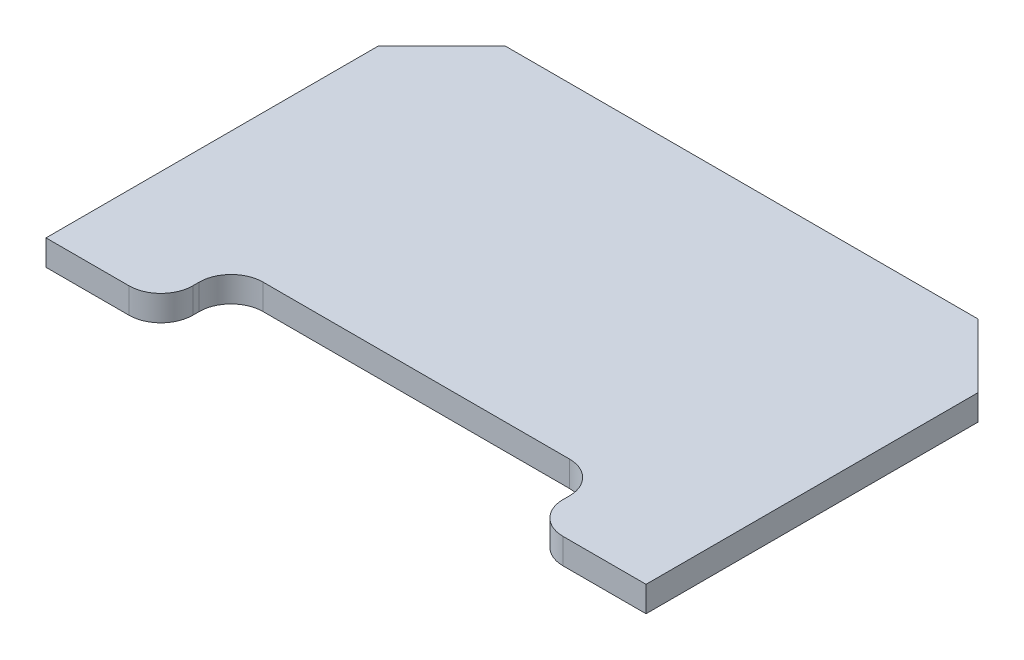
ISO-10303-21;
HEADER;
FILE_DESCRIPTION(('STEP AP214'),'2;1');
FILE_NAME('part.step','',(''),(''),'','','');
FILE_SCHEMA(('AUTOMOTIVE_DESIGN { 1 0 10303 214 1 1 1 1 }'));
ENDSEC;
DATA;
#1=APPLICATION_CONTEXT('core data for automotive mechanical design processes');
#2=APPLICATION_PROTOCOL_DEFINITION('international standard','automotive_design',2000,#1);
#3=PRODUCT_CONTEXT('',#1,'mechanical');
#4=PRODUCT('Part','Part','',(#3));
#5=PRODUCT_RELATED_PRODUCT_CATEGORY('part','',(#4));
#6=PRODUCT_DEFINITION_FORMATION('','',#4);
#7=PRODUCT_DEFINITION_CONTEXT('part definition',#1,'design');
#8=PRODUCT_DEFINITION('design','',#6,#7);
#9=PRODUCT_DEFINITION_SHAPE('','',#8);
#10=(LENGTH_UNIT() NAMED_UNIT(*) SI_UNIT(.MILLI.,.METRE.));
#11=(NAMED_UNIT(*) PLANE_ANGLE_UNIT() SI_UNIT($,.RADIAN.));
#12=(NAMED_UNIT(*) SI_UNIT($,.STERADIAN.) SOLID_ANGLE_UNIT());
#13=UNCERTAINTY_MEASURE_WITH_UNIT(LENGTH_MEASURE(1.E-05),#10,'distance_accuracy_value','');
#14=(GEOMETRIC_REPRESENTATION_CONTEXT(3) GLOBAL_UNCERTAINTY_ASSIGNED_CONTEXT((#13)) GLOBAL_UNIT_ASSIGNED_CONTEXT((#10,
#11,#12)) REPRESENTATION_CONTEXT('',''));
#15=CARTESIAN_POINT('',(0.,0.,0.));
#16=DIRECTION('',(0.,0.,1.));
#17=DIRECTION('',(1.,0.,0.));
#18=AXIS2_PLACEMENT_3D('',#15,#16,#17);
#19=CARTESIAN_POINT('',(299.994592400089,-5085.00062733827,-274.71738478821));
#20=DIRECTION('',(-2.09112818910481E-06,-0.999999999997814,0.));
#21=DIRECTION('',(0.999999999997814,-2.09112818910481E-06,0.));
#22=AXIS2_PLACEMENT_3D('',#19,#20,#21);
#23=PLANE('',#22);
#24=DIRECTION('',(-0.999999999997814,2.09112818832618E-06,0.));
#25=VECTOR('',#24,1.);
#26=CARTESIAN_POINT('',(484.994592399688,-5085.00101419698,-431.450170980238));
#27=LINE('',#26,#25);
#28=CARTESIAN_POINT('',(484.994592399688,-5085.00101419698,-431.450170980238));
#29=VERTEX_POINT('',#28);
#30=CARTESIAN_POINT('',(114.994592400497,-5085.00024047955,-431.450170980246));
#31=VERTEX_POINT('',#30);
#32=EDGE_CURVE('E154',#29,#31,#27,.T.);
#33=ORIENTED_EDGE('',*,*,#32,.F.);
#34=DIRECTION('',(-0.707106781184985,1.47865092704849E-06,-0.707106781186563));
#35=VECTOR('',#34,1.);
#36=CARTESIAN_POINT('',(534.994592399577,-5085.00111875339,-381.450170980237));
#37=LINE('',#36,#35);
#38=CARTESIAN_POINT('',(534.994592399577,-5085.00111875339,-381.450170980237));
#39=VERTEX_POINT('',#38);
#40=EDGE_CURVE('E149',#39,#29,#37,.T.);
#41=ORIENTED_EDGE('',*,*,#40,.F.);
#42=DIRECTION('',(0.,0.,1.));
#43=VECTOR('',#42,1.);
#44=CARTESIAN_POINT('',(534.994592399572,-5085.00111875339,-121.450170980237));
#45=LINE('',#44,#43);
#46=CARTESIAN_POINT('',(534.994592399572,-5085.00111875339,-121.450170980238));
#47=VERTEX_POINT('',#46);
#48=EDGE_CURVE('E144',#47,#39,#45,.F.);
#49=ORIENTED_EDGE('',*,*,#48,.F.);
#50=DIRECTION('',(0.999999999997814,-2.09112818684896E-06,0.));
#51=VECTOR('',#50,1.);
#52=CARTESIAN_POINT('',(469.994592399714,-5085.00098283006,-121.450170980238));
#53=LINE('',#52,#51);
#54=CARTESIAN_POINT('',(469.994592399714,-5085.00098283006,-121.450170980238));
#55=VERTEX_POINT('',#54);
#56=EDGE_CURVE('E128',#55,#47,#53,.T.);
#57=ORIENTED_EDGE('',*,*,#56,.F.);
#58=CARTESIAN_POINT('',(469.994592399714,-5085.00098283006,-146.450170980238));
#59=DIRECTION('',(-2.09112818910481E-06,-0.999999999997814,0.));
#60=DIRECTION('',(0.999999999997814,-2.09112818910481E-06,0.));
#61=AXIS2_PLACEMENT_3D('',#58,#59,#60);
#62=CIRCLE('',#61,25.);
#63=CARTESIAN_POINT('',(444.994592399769,-5085.00093055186,-146.450170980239));
#64=VERTEX_POINT('',#63);
#65=EDGE_CURVE('E19',#64,#55,#62,.F.);
#66=ORIENTED_EDGE('',*,*,#65,.F.);
#67=DIRECTION('',(0.,0.,1.));
#68=VECTOR('',#67,1.);
#69=CARTESIAN_POINT('',(444.994592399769,-5085.00093055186,-151.450170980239));
#70=LINE('',#69,#68);
#71=CARTESIAN_POINT('',(444.994592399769,-5085.00093055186,-151.450170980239));
#72=VERTEX_POINT('',#71);
#73=EDGE_CURVE('E113',#72,#64,#70,.T.);
#74=ORIENTED_EDGE('',*,*,#73,.F.);
#75=CARTESIAN_POINT('',(419.994592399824,-5085.00087827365,-151.450170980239));
#76=DIRECTION('',(-2.09112819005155E-06,-0.999999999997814,0.));
#77=DIRECTION('',(0.999999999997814,-2.09112819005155E-06,0.));
#78=AXIS2_PLACEMENT_3D('',#75,#76,#77);
#79=CIRCLE('',#78,25.);
#80=CARTESIAN_POINT('',(419.994592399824,-5085.00087827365,-176.450170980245));
#81=VERTEX_POINT('',#80);
#82=EDGE_CURVE('E135',#81,#72,#79,.T.);
#83=ORIENTED_EDGE('',*,*,#82,.F.);
#84=DIRECTION('',(0.999999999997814,-2.0911281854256E-06,0.));
#85=VECTOR('',#84,1.);
#86=CARTESIAN_POINT('',(179.994592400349,-5085.00037640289,-176.450170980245));
#87=LINE('',#86,#85);
#88=CARTESIAN_POINT('',(179.994592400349,-5085.00037640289,-176.450170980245));
#89=VERTEX_POINT('',#88);
#90=EDGE_CURVE('E178',#89,#81,#87,.T.);
#91=ORIENTED_EDGE('',*,*,#90,.F.);
#92=CARTESIAN_POINT('',(179.994592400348,-5085.00037640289,-151.450170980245));
#93=DIRECTION('',(-2.09112818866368E-06,-0.999999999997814,0.));
#94=DIRECTION('',(0.999999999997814,-2.09112818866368E-06,0.));
#95=AXIS2_PLACEMENT_3D('',#92,#93,#94);
#96=CIRCLE('',#95,25.);
#97=CARTESIAN_POINT('',(154.994592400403,-5085.00032412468,-151.450170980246));
#98=VERTEX_POINT('',#97);
#99=EDGE_CURVE('E198',#98,#89,#96,.T.);
#100=ORIENTED_EDGE('',*,*,#99,.F.);
#101=DIRECTION('',(0.,0.,1.));
#102=VECTOR('',#101,1.);
#103=CARTESIAN_POINT('',(154.994592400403,-5085.00032412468,-146.450170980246));
#104=LINE('',#103,#102);
#105=CARTESIAN_POINT('',(154.994592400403,-5085.00032412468,-146.450170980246));
#106=VERTEX_POINT('',#105);
#107=EDGE_CURVE('E174',#106,#98,#104,.F.);
#108=ORIENTED_EDGE('',*,*,#107,.F.);
#109=CARTESIAN_POINT('',(129.994592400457,-5085.00027184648,-146.450170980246));
#110=DIRECTION('',(-2.09112818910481E-06,-0.999999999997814,0.));
#111=DIRECTION('',(0.999999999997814,-2.09112818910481E-06,0.));
#112=AXIS2_PLACEMENT_3D('',#109,#110,#111);
#113=CIRCLE('',#112,25.);
#114=CARTESIAN_POINT('',(129.994592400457,-5085.00027184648,-121.450170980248));
#115=VERTEX_POINT('',#114);
#116=EDGE_CURVE('E196',#115,#106,#113,.F.);
#117=ORIENTED_EDGE('',*,*,#116,.F.);
#118=DIRECTION('',(0.999999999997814,-2.09112820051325E-06,0.));
#119=VECTOR('',#118,1.);
#120=CARTESIAN_POINT('',(64.994592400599,-5085.00013592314,-121.450170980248));
#121=LINE('',#120,#119);
#122=CARTESIAN_POINT('',(64.994592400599,-5085.00013592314,-121.450170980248));
#123=VERTEX_POINT('',#122);
#124=EDGE_CURVE('E169',#123,#115,#121,.T.);
#125=ORIENTED_EDGE('',*,*,#124,.F.);
#126=DIRECTION('',(0.,0.,1.));
#127=VECTOR('',#126,1.);
#128=CARTESIAN_POINT('',(64.9945924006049,-5085.00013592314,-381.450170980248));
#129=LINE('',#128,#127);
#130=CARTESIAN_POINT('',(64.994592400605,-5085.00013592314,-381.450170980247));
#131=VERTEX_POINT('',#130);
#132=EDGE_CURVE('E164',#131,#123,#129,.T.);
#133=ORIENTED_EDGE('',*,*,#132,.F.);
#134=DIRECTION('',(-0.707106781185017,1.47865092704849E-06,0.707106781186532));
#135=VECTOR('',#134,1.);
#136=CARTESIAN_POINT('',(114.994592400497,-5085.00024047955,-431.450170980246));
#137=LINE('',#136,#135);
#138=EDGE_CURVE('E159',#31,#131,#137,.T.);
#139=ORIENTED_EDGE('',*,*,#138,.F.);
#140=EDGE_LOOP('',(#33,#41,#49,#57,#66,#74,#83,#91,#100,#108,#117,#125,#133,#139));
#141=FACE_BOUND('',#140,.T.);
#142=ADVANCED_FACE('F16',(#141),#23,.T.);
#143=CARTESIAN_POINT('',(469.994634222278,-5065.0009828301,-146.450170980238));
#144=DIRECTION('',(-2.09112818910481E-06,-0.999999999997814,0.));
#145=DIRECTION('',(0.999999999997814,-2.09112818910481E-06,0.));
#146=AXIS2_PLACEMENT_3D('',#143,#144,#145);
#147=CYLINDRICAL_SURFACE('',#146,25.);
#148=CARTESIAN_POINT('',(469.994634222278,-5065.0009828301,-146.450170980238));
#149=DIRECTION('',(-2.09112818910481E-06,-0.999999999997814,0.));
#150=DIRECTION('',(0.999999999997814,-2.09112818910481E-06,0.));
#151=AXIS2_PLACEMENT_3D('',#148,#149,#150);
#152=CIRCLE('',#151,25.);
#153=CARTESIAN_POINT('',(469.994634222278,-5065.0009828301,-121.450170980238));
#154=VERTEX_POINT('',#153);
#155=CARTESIAN_POINT('',(444.994634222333,-5065.0009305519,-146.450170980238));
#156=VERTEX_POINT('',#155);
#157=EDGE_CURVE('E134',#154,#156,#152,.T.);
#158=ORIENTED_EDGE('',*,*,#157,.T.);
#159=DIRECTION('',(-2.09112818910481E-06,-0.999999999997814,0.));
#160=VECTOR('',#159,1.);
#161=CARTESIAN_POINT('',(444.994634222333,-5065.0009305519,-146.450170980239));
#162=LINE('',#161,#160);
#163=EDGE_CURVE('E118',#64,#156,#162,.F.);
#164=ORIENTED_EDGE('',*,*,#163,.F.);
#165=ORIENTED_EDGE('',*,*,#65,.T.);
#166=DIRECTION('',(-2.09112818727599E-06,-0.999999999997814,0.));
#167=VECTOR('',#166,1.);
#168=CARTESIAN_POINT('',(469.994634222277,-5065.0009828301,-121.450170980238));
#169=LINE('',#168,#167);
#170=EDGE_CURVE('E195',#154,#55,#169,.T.);
#171=ORIENTED_EDGE('',*,*,#170,.F.);
#172=EDGE_LOOP('',(#158,#164,#165,#171));
#173=FACE_BOUND('',#172,.T.);
#174=ADVANCED_FACE('F133',(#173),#147,.T.);
#175=CARTESIAN_POINT('',(444.994634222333,-5065.0009305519,-151.450170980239));
#176=DIRECTION('',(-0.999999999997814,2.09112818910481E-06,0.));
#177=DIRECTION('',(-2.09112818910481E-06,-0.999999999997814,0.));
#178=AXIS2_PLACEMENT_3D('',#175,#176,#177);
#179=PLANE('',#178);
#180=DIRECTION('',(0.,0.,1.));
#181=VECTOR('',#180,1.);
#182=CARTESIAN_POINT('',(444.994634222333,-5065.0009305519,-274.71738478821));
#183=LINE('',#182,#181);
#184=CARTESIAN_POINT('',(444.994634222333,-5065.0009305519,-151.450170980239));
#185=VERTEX_POINT('',#184);
#186=EDGE_CURVE('E193',#156,#185,#183,.F.);
#187=ORIENTED_EDGE('',*,*,#186,.T.);
#188=DIRECTION('',(-2.09112818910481E-06,-0.999999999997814,0.));
#189=VECTOR('',#188,1.);
#190=CARTESIAN_POINT('',(444.994634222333,-5065.0009305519,-151.450170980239));
#191=LINE('',#190,#189);
#192=EDGE_CURVE('E120',#72,#185,#191,.F.);
#193=ORIENTED_EDGE('',*,*,#192,.F.);
#194=ORIENTED_EDGE('',*,*,#73,.T.);
#195=ORIENTED_EDGE('',*,*,#163,.T.);
#196=EDGE_LOOP('',(#187,#193,#194,#195));
#197=FACE_BOUND('',#196,.T.);
#198=ADVANCED_FACE('F116',(#197),#179,.T.);
#199=CARTESIAN_POINT('',(419.994634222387,-5065.00087827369,-151.450170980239));
#200=DIRECTION('',(-2.09112819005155E-06,-0.999999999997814,0.));
#201=DIRECTION('',(0.999999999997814,-2.09112819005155E-06,0.));
#202=AXIS2_PLACEMENT_3D('',#199,#200,#201);
#203=CYLINDRICAL_SURFACE('',#202,25.);
#204=CARTESIAN_POINT('',(419.994634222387,-5065.00087827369,-151.450170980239));
#205=DIRECTION('',(-2.09112819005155E-06,-0.999999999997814,0.));
#206=DIRECTION('',(0.999999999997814,-2.09112819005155E-06,0.));
#207=AXIS2_PLACEMENT_3D('',#204,#205,#206);
#208=CIRCLE('',#207,25.);
#209=CARTESIAN_POINT('',(419.994634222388,-5065.00087827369,-176.450170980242));
#210=VERTEX_POINT('',#209);
#211=EDGE_CURVE('E190',#185,#210,#208,.F.);
#212=ORIENTED_EDGE('',*,*,#211,.T.);
#213=DIRECTION('',(2.09112819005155E-06,0.999999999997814,0.));
#214=VECTOR('',#213,1.);
#215=CARTESIAN_POINT('',(419.994592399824,-5085.00087827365,-176.450170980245));
#216=LINE('',#215,#214);
#217=EDGE_CURVE('E179',#81,#210,#216,.T.);
#218=ORIENTED_EDGE('',*,*,#217,.F.);
#219=ORIENTED_EDGE('',*,*,#82,.T.);
#220=ORIENTED_EDGE('',*,*,#192,.T.);
#221=EDGE_LOOP('',(#212,#218,#219,#220));
#222=FACE_BOUND('',#221,.T.);
#223=ADVANCED_FACE('F289',(#222),#203,.F.);
#224=CARTESIAN_POINT('',(179.994634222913,-5065.00037640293,-176.450170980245));
#225=DIRECTION('',(0.,0.,1.));
#226=DIRECTION('',(0.,-1.,0.));
#227=AXIS2_PLACEMENT_3D('',#224,#225,#226);
#228=PLANE('',#227);
#229=DIRECTION('',(0.999999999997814,-2.09112818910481E-06,0.));
#230=VECTOR('',#229,1.);
#231=CARTESIAN_POINT('',(299.994634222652,-5065.00062733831,-176.450170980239));
#232=LINE('',#231,#230);
#233=CARTESIAN_POINT('',(179.994634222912,-5065.00037640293,-176.450170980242));
#234=VERTEX_POINT('',#233);
#235=EDGE_CURVE('E189',#210,#234,#232,.F.);
#236=ORIENTED_EDGE('',*,*,#235,.T.);
#237=DIRECTION('',(-2.09112818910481E-06,-0.999999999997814,0.));
#238=VECTOR('',#237,1.);
#239=CARTESIAN_POINT('',(179.994634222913,-5065.00037640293,-176.450170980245));
#240=LINE('',#239,#238);
#241=EDGE_CURVE('E177',#89,#234,#240,.F.);
#242=ORIENTED_EDGE('',*,*,#241,.F.);
#243=ORIENTED_EDGE('',*,*,#90,.T.);
#244=ORIENTED_EDGE('',*,*,#217,.T.);
#245=EDGE_LOOP('',(#236,#242,#243,#244));
#246=FACE_BOUND('',#245,.T.);
#247=ADVANCED_FACE('F286',(#246),#228,.T.);
#248=CARTESIAN_POINT('',(179.994634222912,-5065.00037640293,-151.450170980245));
#249=DIRECTION('',(-2.09112818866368E-06,-0.999999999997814,0.));
#250=DIRECTION('',(0.999999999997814,-2.09112818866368E-06,0.));
#251=AXIS2_PLACEMENT_3D('',#248,#249,#250);
#252=CYLINDRICAL_SURFACE('',#251,25.);
#253=CARTESIAN_POINT('',(179.994634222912,-5065.00037640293,-151.450170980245));
#254=DIRECTION('',(-2.09112818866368E-06,-0.999999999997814,0.));
#255=DIRECTION('',(0.999999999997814,-2.09112818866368E-06,0.));
#256=AXIS2_PLACEMENT_3D('',#253,#254,#255);
#257=CIRCLE('',#256,25.);
#258=CARTESIAN_POINT('',(154.994634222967,-5065.00032412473,-151.450170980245));
#259=VERTEX_POINT('',#258);
#260=EDGE_CURVE('E186',#234,#259,#257,.F.);
#261=ORIENTED_EDGE('',*,*,#260,.T.);
#262=DIRECTION('',(2.09112818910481E-06,0.999999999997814,0.));
#263=VECTOR('',#262,1.);
#264=CARTESIAN_POINT('',(154.994634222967,-5065.00032412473,-151.450170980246));
#265=LINE('',#264,#263);
#266=EDGE_CURVE('E176',#98,#259,#265,.T.);
#267=ORIENTED_EDGE('',*,*,#266,.F.);
#268=ORIENTED_EDGE('',*,*,#99,.T.);
#269=ORIENTED_EDGE('',*,*,#241,.T.);
#270=EDGE_LOOP('',(#261,#267,#268,#269));
#271=FACE_BOUND('',#270,.T.);
#272=ADVANCED_FACE('F284',(#271),#252,.F.);
#273=CARTESIAN_POINT('',(154.994634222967,-5065.00032412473,-146.450170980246));
#274=DIRECTION('',(0.999999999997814,-2.09112818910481E-06,0.));
#275=DIRECTION('',(2.09112818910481E-06,0.999999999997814,0.));
#276=AXIS2_PLACEMENT_3D('',#273,#274,#275);
#277=PLANE('',#276);
#278=DIRECTION('',(0.,0.,1.));
#279=VECTOR('',#278,1.);
#280=CARTESIAN_POINT('',(154.994634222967,-5065.00032412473,-274.71738478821));
#281=LINE('',#280,#279);
#282=CARTESIAN_POINT('',(154.994634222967,-5065.00032412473,-146.450170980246));
#283=VERTEX_POINT('',#282);
#284=EDGE_CURVE('E185',#259,#283,#281,.T.);
#285=ORIENTED_EDGE('',*,*,#284,.T.);
#286=DIRECTION('',(-2.09112818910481E-06,-0.999999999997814,0.));
#287=VECTOR('',#286,1.);
#288=CARTESIAN_POINT('',(154.994634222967,-5065.00032412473,-146.450170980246));
#289=LINE('',#288,#287);
#290=EDGE_CURVE('E171',#106,#283,#289,.F.);
#291=ORIENTED_EDGE('',*,*,#290,.F.);
#292=ORIENTED_EDGE('',*,*,#107,.T.);
#293=ORIENTED_EDGE('',*,*,#266,.T.);
#294=EDGE_LOOP('',(#285,#291,#292,#293));
#295=FACE_BOUND('',#294,.T.);
#296=ADVANCED_FACE('F282',(#295),#277,.T.);
#297=CARTESIAN_POINT('',(129.994634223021,-5065.00027184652,-146.450170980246));
#298=DIRECTION('',(-2.09112818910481E-06,-0.999999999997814,0.));
#299=DIRECTION('',(0.999999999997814,-2.09112818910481E-06,0.));
#300=AXIS2_PLACEMENT_3D('',#297,#298,#299);
#301=CYLINDRICAL_SURFACE('',#300,25.);
#302=CARTESIAN_POINT('',(129.994634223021,-5065.00027184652,-146.450170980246));
#303=DIRECTION('',(-2.09112818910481E-06,-0.999999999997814,0.));
#304=DIRECTION('',(0.999999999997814,-2.09112818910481E-06,0.));
#305=AXIS2_PLACEMENT_3D('',#302,#303,#304);
#306=CIRCLE('',#305,25.);
#307=CARTESIAN_POINT('',(129.994634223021,-5065.00027184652,-121.450170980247));
#308=VERTEX_POINT('',#307);
#309=EDGE_CURVE('E181',#283,#308,#306,.T.);
#310=ORIENTED_EDGE('',*,*,#309,.T.);
#311=DIRECTION('',(2.09112818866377E-06,0.999999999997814,0.));
#312=VECTOR('',#311,1.);
#313=CARTESIAN_POINT('',(129.994592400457,-5085.00027184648,-121.450170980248));
#314=LINE('',#313,#312);
#315=EDGE_CURVE('E166',#115,#308,#314,.T.);
#316=ORIENTED_EDGE('',*,*,#315,.F.);
#317=ORIENTED_EDGE('',*,*,#116,.T.);
#318=ORIENTED_EDGE('',*,*,#290,.T.);
#319=EDGE_LOOP('',(#310,#316,#317,#318));
#320=FACE_BOUND('',#319,.T.);
#321=ADVANCED_FACE('F277',(#320),#301,.T.);
#322=CARTESIAN_POINT('',(64.9946342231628,-5065.00013592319,-121.450170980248));
#323=DIRECTION('',(0.,0.,1.));
#324=DIRECTION('',(0.,-1.,0.));
#325=AXIS2_PLACEMENT_3D('',#322,#323,#324);
#326=PLANE('',#325);
#327=DIRECTION('',(0.999999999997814,-2.09112818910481E-06,0.));
#328=VECTOR('',#327,1.);
#329=CARTESIAN_POINT('',(299.994634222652,-5065.00062733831,-121.450170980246));
#330=LINE('',#329,#328);
#331=CARTESIAN_POINT('',(64.9946342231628,-5065.00013592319,-121.450170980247));
#332=VERTEX_POINT('',#331);
#333=EDGE_CURVE('E184',#308,#332,#330,.F.);
#334=ORIENTED_EDGE('',*,*,#333,.T.);
#335=DIRECTION('',(-2.09112818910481E-06,-0.999999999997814,0.));
#336=VECTOR('',#335,1.);
#337=CARTESIAN_POINT('',(64.9946342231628,-5065.00013592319,-121.450170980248));
#338=LINE('',#337,#336);
#339=EDGE_CURVE('E161',#123,#332,#338,.F.);
#340=ORIENTED_EDGE('',*,*,#339,.F.);
#341=ORIENTED_EDGE('',*,*,#124,.T.);
#342=ORIENTED_EDGE('',*,*,#315,.T.);
#343=EDGE_LOOP('',(#334,#340,#341,#342));
#344=FACE_BOUND('',#343,.T.);
#345=ADVANCED_FACE('F267',(#344),#326,.T.);
#346=CARTESIAN_POINT('',(64.9946342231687,-5065.00013592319,-381.450170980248));
#347=DIRECTION('',(-0.999999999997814,2.09112818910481E-06,0.));
#348=DIRECTION('',(-2.09112818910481E-06,-0.999999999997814,0.));
#349=AXIS2_PLACEMENT_3D('',#346,#347,#348);
#350=PLANE('',#349);
#351=DIRECTION('',(0.,0.,1.));
#352=VECTOR('',#351,1.);
#353=CARTESIAN_POINT('',(64.9946342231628,-5065.00013592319,-274.71738478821));
#354=LINE('',#353,#352);
#355=CARTESIAN_POINT('',(64.9946342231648,-5065.00013592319,-381.450170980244));
#356=VERTEX_POINT('',#355);
#357=EDGE_CURVE('E217',#332,#356,#354,.F.);
#358=ORIENTED_EDGE('',*,*,#357,.T.);
#359=DIRECTION('',(2.09112818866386E-06,0.999999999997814,0.));
#360=VECTOR('',#359,1.);
#361=CARTESIAN_POINT('',(64.994592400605,-5085.00013592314,-381.450170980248));
#362=LINE('',#361,#360);
#363=EDGE_CURVE('E156',#131,#356,#362,.T.);
#364=ORIENTED_EDGE('',*,*,#363,.F.);
#365=ORIENTED_EDGE('',*,*,#132,.T.);
#366=ORIENTED_EDGE('',*,*,#339,.T.);
#367=EDGE_LOOP('',(#358,#364,#365,#366));
#368=FACE_BOUND('',#367,.T.);
#369=ADVANCED_FACE('F296',(#368),#350,.T.);
#370=CARTESIAN_POINT('',(114.994634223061,-5065.0002404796,-431.450170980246));
#371=DIRECTION('',(-0.707106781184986,1.47865092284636E-06,-0.707106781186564));
#372=DIRECTION('',(-0.707106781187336,0.,0.707106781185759));
#373=AXIS2_PLACEMENT_3D('',#370,#371,#372);
#374=PLANE('',#373);
#375=DIRECTION('',(0.707106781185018,-1.47865092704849E-06,-0.70710678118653));
#376=VECTOR('',#375,1.);
#377=CARTESIAN_POINT('',(64.9946342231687,-5065.00013592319,-381.450170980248));
#378=LINE('',#377,#376);
#379=CARTESIAN_POINT('',(114.994634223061,-5065.0002404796,-431.450170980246));
#380=VERTEX_POINT('',#379);
#381=EDGE_CURVE('E220',#356,#380,#378,.T.);
#382=ORIENTED_EDGE('',*,*,#381,.T.);
#383=DIRECTION('',(2.09112819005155E-06,0.999999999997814,0.));
#384=VECTOR('',#383,1.);
#385=CARTESIAN_POINT('',(114.994592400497,-5085.00024047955,-431.450170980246));
#386=LINE('',#385,#384);
#387=EDGE_CURVE('E151',#31,#380,#386,.T.);
#388=ORIENTED_EDGE('',*,*,#387,.F.);
#389=ORIENTED_EDGE('',*,*,#138,.T.);
#390=ORIENTED_EDGE('',*,*,#363,.T.);
#391=EDGE_LOOP('',(#382,#388,#389,#390));
#392=FACE_BOUND('',#391,.T.);
#393=ADVANCED_FACE('F298',(#392),#374,.T.);
#394=CARTESIAN_POINT('',(484.994634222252,-5065.00101419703,-431.450170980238));
#395=DIRECTION('',(0.,0.,-1.));
#396=DIRECTION('',(-1.,0.,0.));
#397=AXIS2_PLACEMENT_3D('',#394,#395,#396);
#398=PLANE('',#397);
#399=DIRECTION('',(0.999999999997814,-2.09112818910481E-06,0.));
#400=VECTOR('',#399,1.);
#401=CARTESIAN_POINT('',(299.994634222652,-5065.00062733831,-431.450170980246));
#402=LINE('',#401,#400);
#403=CARTESIAN_POINT('',(484.994634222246,-5065.00101419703,-431.450170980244));
#404=VERTEX_POINT('',#403);
#405=EDGE_CURVE('E228',#380,#404,#402,.T.);
#406=ORIENTED_EDGE('',*,*,#405,.T.);
#407=DIRECTION('',(2.09112818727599E-06,0.999999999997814,0.));
#408=VECTOR('',#407,1.);
#409=CARTESIAN_POINT('',(484.994592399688,-5085.00101419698,-431.450170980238));
#410=LINE('',#409,#408);
#411=EDGE_CURVE('E146',#29,#404,#410,.T.);
#412=ORIENTED_EDGE('',*,*,#411,.F.);
#413=ORIENTED_EDGE('',*,*,#32,.T.);
#414=ORIENTED_EDGE('',*,*,#387,.T.);
#415=EDGE_LOOP('',(#406,#412,#413,#414));
#416=FACE_BOUND('',#415,.T.);
#417=ADVANCED_FACE('F303',(#416),#398,.T.);
#418=CARTESIAN_POINT('',(534.994634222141,-5065.00111875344,-381.450170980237));
#419=DIRECTION('',(0.707106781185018,-1.47865092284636E-06,-0.707106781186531));
#420=DIRECTION('',(-0.707106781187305,0.,-0.707106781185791));
#421=AXIS2_PLACEMENT_3D('',#418,#419,#420);
#422=PLANE('',#421);
#423=DIRECTION('',(0.707106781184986,-1.47865092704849E-06,0.707106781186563));
#424=VECTOR('',#423,1.);
#425=CARTESIAN_POINT('',(484.994634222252,-5065.00101419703,-431.450170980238));
#426=LINE('',#425,#424);
#427=CARTESIAN_POINT('',(534.994634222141,-5065.00111875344,-381.450170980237));
#428=VERTEX_POINT('',#427);
#429=EDGE_CURVE('E236',#404,#428,#426,.T.);
#430=ORIENTED_EDGE('',*,*,#429,.T.);
#431=DIRECTION('',(2.09112818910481E-06,0.999999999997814,0.));
#432=VECTOR('',#431,1.);
#433=CARTESIAN_POINT('',(534.994634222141,-5065.00111875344,-381.450170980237));
#434=LINE('',#433,#432);
#435=EDGE_CURVE('E141',#39,#428,#434,.T.);
#436=ORIENTED_EDGE('',*,*,#435,.F.);
#437=ORIENTED_EDGE('',*,*,#40,.T.);
#438=ORIENTED_EDGE('',*,*,#411,.T.);
#439=EDGE_LOOP('',(#430,#436,#437,#438));
#440=FACE_BOUND('',#439,.T.);
#441=ADVANCED_FACE('F307',(#440),#422,.T.);
#442=CARTESIAN_POINT('',(534.994634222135,-5065.00111875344,-121.450170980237));
#443=DIRECTION('',(0.999999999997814,-2.09112818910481E-06,0.));
#444=DIRECTION('',(2.09112818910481E-06,0.999999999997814,0.));
#445=AXIS2_PLACEMENT_3D('',#442,#443,#444);
#446=PLANE('',#445);
#447=DIRECTION('',(0.,0.,1.));
#448=VECTOR('',#447,1.);
#449=CARTESIAN_POINT('',(534.994634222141,-5065.00111875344,-274.71738478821));
#450=LINE('',#449,#448);
#451=CARTESIAN_POINT('',(534.994634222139,-5065.00111875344,-121.450170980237));
#452=VERTEX_POINT('',#451);
#453=EDGE_CURVE('E25',#428,#452,#450,.T.);
#454=ORIENTED_EDGE('',*,*,#453,.T.);
#455=DIRECTION('',(2.09112818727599E-06,0.999999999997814,0.));
#456=VECTOR('',#455,1.);
#457=CARTESIAN_POINT('',(534.994592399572,-5085.00111875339,-121.450170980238));
#458=LINE('',#457,#456);
#459=EDGE_CURVE('E33',#47,#452,#458,.T.);
#460=ORIENTED_EDGE('',*,*,#459,.F.);
#461=ORIENTED_EDGE('',*,*,#48,.T.);
#462=ORIENTED_EDGE('',*,*,#435,.T.);
#463=EDGE_LOOP('',(#454,#460,#461,#462));
#464=FACE_BOUND('',#463,.T.);
#465=ADVANCED_FACE('F309',(#464),#446,.T.);
#466=CARTESIAN_POINT('',(469.994634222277,-5065.0009828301,-121.450170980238));
#467=DIRECTION('',(0.,0.,1.));
#468=DIRECTION('',(0.,-1.,0.));
#469=AXIS2_PLACEMENT_3D('',#466,#467,#468);
#470=PLANE('',#469);
#471=DIRECTION('',(0.999999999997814,-2.09112818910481E-06,0.));
#472=VECTOR('',#471,1.);
#473=CARTESIAN_POINT('',(299.994634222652,-5065.00062733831,-121.450170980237));
#474=LINE('',#473,#472);
#475=EDGE_CURVE('E10',#452,#154,#474,.F.);
#476=ORIENTED_EDGE('',*,*,#475,.T.);
#477=ORIENTED_EDGE('',*,*,#170,.T.);
#478=ORIENTED_EDGE('',*,*,#56,.T.);
#479=ORIENTED_EDGE('',*,*,#459,.T.);
#480=EDGE_LOOP('',(#476,#477,#478,#479));
#481=FACE_BOUND('',#480,.T.);
#482=ADVANCED_FACE('F310',(#481),#470,.T.);
#483=CARTESIAN_POINT('',(299.994634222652,-5065.00062733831,-274.71738478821));
#484=DIRECTION('',(-2.09112818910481E-06,-0.999999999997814,0.));
#485=DIRECTION('',(0.999999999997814,-2.09112818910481E-06,0.));
#486=AXIS2_PLACEMENT_3D('',#483,#484,#485);
#487=PLANE('',#486);
#488=ORIENTED_EDGE('',*,*,#453,.F.);
#489=ORIENTED_EDGE('',*,*,#429,.F.);
#490=ORIENTED_EDGE('',*,*,#405,.F.);
#491=ORIENTED_EDGE('',*,*,#381,.F.);
#492=ORIENTED_EDGE('',*,*,#357,.F.);
#493=ORIENTED_EDGE('',*,*,#333,.F.);
#494=ORIENTED_EDGE('',*,*,#309,.F.);
#495=ORIENTED_EDGE('',*,*,#284,.F.);
#496=ORIENTED_EDGE('',*,*,#260,.F.);
#497=ORIENTED_EDGE('',*,*,#235,.F.);
#498=ORIENTED_EDGE('',*,*,#211,.F.);
#499=ORIENTED_EDGE('',*,*,#186,.F.);
#500=ORIENTED_EDGE('',*,*,#157,.F.);
#501=ORIENTED_EDGE('',*,*,#475,.F.);
#502=EDGE_LOOP('',(#488,#489,#490,#491,#492,#493,#494,#495,#496,#497,#498,#499,#500,#501));
#503=FACE_BOUND('',#502,.T.);
#504=ADVANCED_FACE('F273',(#503),#487,.F.);
#505=CLOSED_SHELL('',(#142,#174,#198,#223,#247,#272,#296,#321,#345,#369,#393,#417,#441,#465,
#482,#504));
#506=MANIFOLD_SOLID_BREP('B1',#505);
#507=ADVANCED_BREP_SHAPE_REPRESENTATION('',(#18,#506),#14);
#508=SHAPE_DEFINITION_REPRESENTATION(#9,#507);
ENDSEC;
END-ISO-10303-21;
